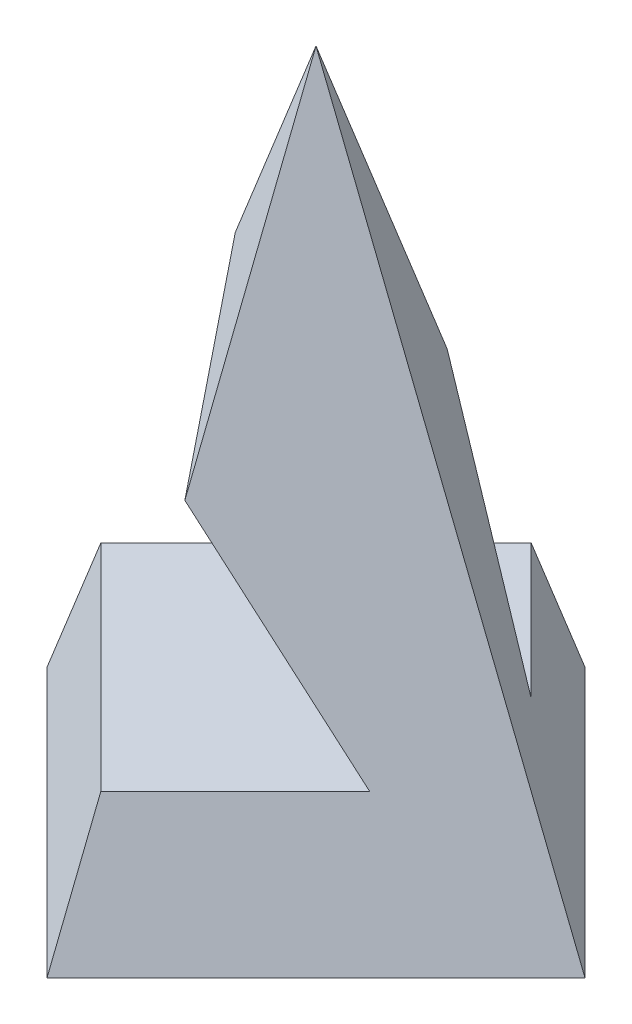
from build123d import *

# Parameters (mm, degrees)
CUT_EXTRUDE_1_DEPTH      = 46.956501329
CUT_EXTRUDE_1_DEPTH_BACK = 46.956501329


with BuildPart() as part:
    # Sketch 1 → Loft 1 section 0
    with BuildSketch(Plane(origin=(0, 0, 0), x_dir=(1, 0, 0), z_dir=(0, 1, 0)), mode=Mode.PRIVATE) as loft_1_s0:
        with BuildLine():
            Line((0, -16), (16, 0))
            Line((16, 0), (0, 16))
            Line((0, 16), (-16, 0))
            Line((-16, 0), (0, -16))
        make_face()
    loft([Vertex(0, 40, 0), loft_1_s0.sketch])

    # Sketch 3 → Cut-Extrude 1 (cut, two sides: drawn at the far end of the back side and taken through both)
    with BuildSketch(Plane.XY.offset(-CUT_EXTRUDE_1_DEPTH_BACK)):
        Polygon((-115.378141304, 8), (-15.530289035, 8), (8, 8), (-7.183131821, 31.72364347), (-61.006485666, 115.822633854), (-239.314208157, 205.737763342), (-293.685863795, 97.915129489), align=None)
    extrude(amount=CUT_EXTRUDE_1_DEPTH + CUT_EXTRUDE_1_DEPTH_BACK, mode=Mode.SUBTRACT)


solid = part.part
